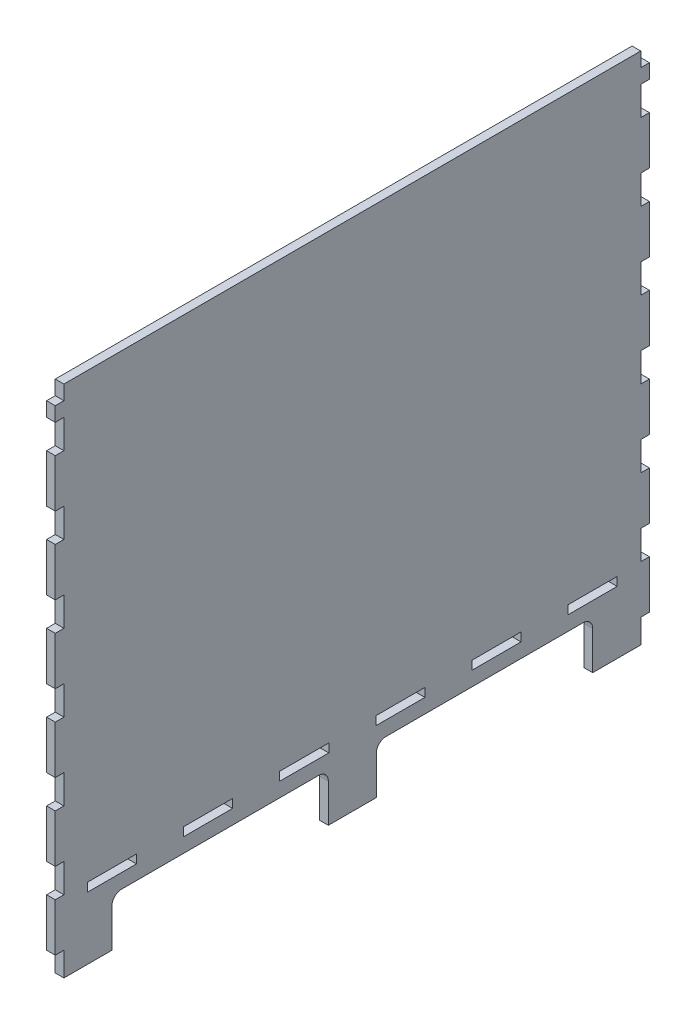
from build123d import *

# Parameters (mm, degrees)
BOSS_EXTRUDE1_DEPTH = 9
SKETCH2_W           = 51
SKETCH2_H           = 9
CUT_EXTRUDE1_DEPTH  = 424.40920457
LPATTERN1_COUNT     = 6
LPATTERN1_PITCH     = 100


with BuildPart() as part:
    # Sketch1 → Boss-Extrude1 (new body)
    with BuildSketch(Plane(origin=(0, 0, 0), x_dir=(0, 0, -1), z_dir=(1, 0, 0))):
        with BuildLine():
            Line((-300, -264.332601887), (-300, -289.332601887))
            Line((-300, -289.332601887), (-250, -289.332601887))
            Line((-250, -289.332601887), (-250, -249.332601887))
            ThreePointArc((-250, -249.332601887), (-247.071067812, -242.261534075), (-240, -239.332601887))
            Line((-240, -239.332601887), (-35, -239.332601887))
            ThreePointArc((-35, -239.332601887), (-27.928932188, -242.261534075), (-25, -249.332601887))
            Line((-25, -249.332601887), (-25, -289.332601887))
            Line((-25, -289.332601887), (25, -289.332601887))
            Line((25, -289.332601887), (25, -249.332601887))
            ThreePointArc((25, -249.332601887), (27.928932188, -242.261534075), (35, -239.332601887))
            Line((35, -239.332601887), (240, -239.332601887))
            ThreePointArc((240, -239.332601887), (247.071067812, -242.261534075), (250, -249.332601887))
            Line((250, -249.332601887), (250, -289.332601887))
            Line((250, -289.332601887), (300, -289.332601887))
            Line((300, -289.332601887), (300, -264.332601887))
            Line((300, -264.332601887), (309, -264.332601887))
            Line((309, -264.332601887), (309, -214.332601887))
            Line((309, -214.332601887), (300, -214.332601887))
            Line((300, -214.332601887), (300, -184.332601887))
            Line((300, -184.332601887), (309, -184.332601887))
            Line((309, -184.332601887), (309, -134.332601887))
            Line((309, -134.332601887), (300, -134.332601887))
            Line((300, -134.332601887), (300, -104.332601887))
            Line((300, -104.332601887), (309, -104.332601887))
            Line((309, -104.332601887), (309, -54.332601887))
            Line((309, -54.332601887), (300, -54.332601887))
            Line((300, -54.332601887), (300, -24.332601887))
            Line((300, -24.332601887), (309, -24.332601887))
            Line((309, -24.332601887), (309, 25.667398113))
            Line((309, 25.667398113), (300, 25.667398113))
            Line((300, 25.667398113), (300, 55.667398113))
            Line((300, 55.667398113), (309, 55.667398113))
            Line((309, 55.667398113), (309, 105.667398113))
            Line((309, 105.667398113), (300, 105.667398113))
            Line((300, 105.667398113), (300, 135.667398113))
            Line((300, 135.667398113), (309, 135.667398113))
            Line((309, 135.667398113), (309, 185.667398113))
            Line((309, 185.667398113), (300, 185.667398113))
            Line((300, 185.667398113), (300, 215.667398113))
            Line((300, 215.667398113), (309, 215.667398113))
            Line((309, 215.667398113), (309, 230.667398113))
            Line((309, 230.667398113), (300, 230.667398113))
            Line((300, 230.667398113), (300, 245.667398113))
            Line((300, 245.667398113), (-300, 245.667398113))
            Line((-300, 245.667398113), (-300, 230.667398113))
            Line((-300, 230.667398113), (-309, 230.667398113))
            Line((-309, 230.667398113), (-309, 215.667398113))
            Line((-309, 215.667398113), (-300, 215.667398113))
            Line((-300, 215.667398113), (-300, 185.667398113))
            Line((-300, 185.667398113), (-309, 185.667398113))
            Line((-309, 185.667398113), (-309, 135.667398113))
            Line((-309, 135.667398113), (-300, 135.667398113))
            Line((-300, 135.667398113), (-300, 105.667398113))
            Line((-300, 105.667398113), (-309, 105.667398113))
            Line((-309, 105.667398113), (-309, 55.667398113))
            Line((-309, 55.667398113), (-300, 55.667398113))
            Line((-300, 55.667398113), (-300, 25.667398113))
            Line((-300, 25.667398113), (-309, 25.667398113))
            Line((-309, 25.667398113), (-309, -24.332601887))
            Line((-309, -24.332601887), (-300, -24.332601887))
            Line((-300, -24.332601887), (-300, -54.332601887))
            Line((-300, -54.332601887), (-309, -54.332601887))
            Line((-309, -54.332601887), (-309, -104.332601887))
            Line((-309, -104.332601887), (-300, -104.332601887))
            Line((-300, -104.332601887), (-300, -134.332601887))
            Line((-300, -134.332601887), (-309, -134.332601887))
            Line((-309, -134.332601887), (-309, -184.332601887))
            Line((-309, -184.332601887), (-300, -184.332601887))
            Line((-300, -184.332601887), (-300, -214.332601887))
            Line((-300, -214.332601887), (-309, -214.332601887))
            Line((-309, -214.332601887), (-309, -264.332601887))
            Line((-309, -264.332601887), (-300, -264.332601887))
        make_face()
    extrude(amount=BOSS_EXTRUDE1_DEPTH)

    # Sketch2 → Cut-Extrude1 (cut, through all)
    with BuildSketch(Plane(origin=(9, 0, 0), x_dir=(0, 0, -1), z_dir=(1, 0, 0))):
        with Locations((-250, -219.832601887)):
            Rectangle(SKETCH2_W, SKETCH2_H)
    cut_extrude1 = extrude(amount=-CUT_EXTRUDE1_DEPTH, mode=Mode.SUBTRACT)

    # LPattern1: Cut-Extrude1 ×6
    with Locations(*[(0, 0, -i * LPATTERN1_PITCH) for i in range(1, LPATTERN1_COUNT)]):
        add(cut_extrude1, mode=Mode.SUBTRACT)


solid = part.part
